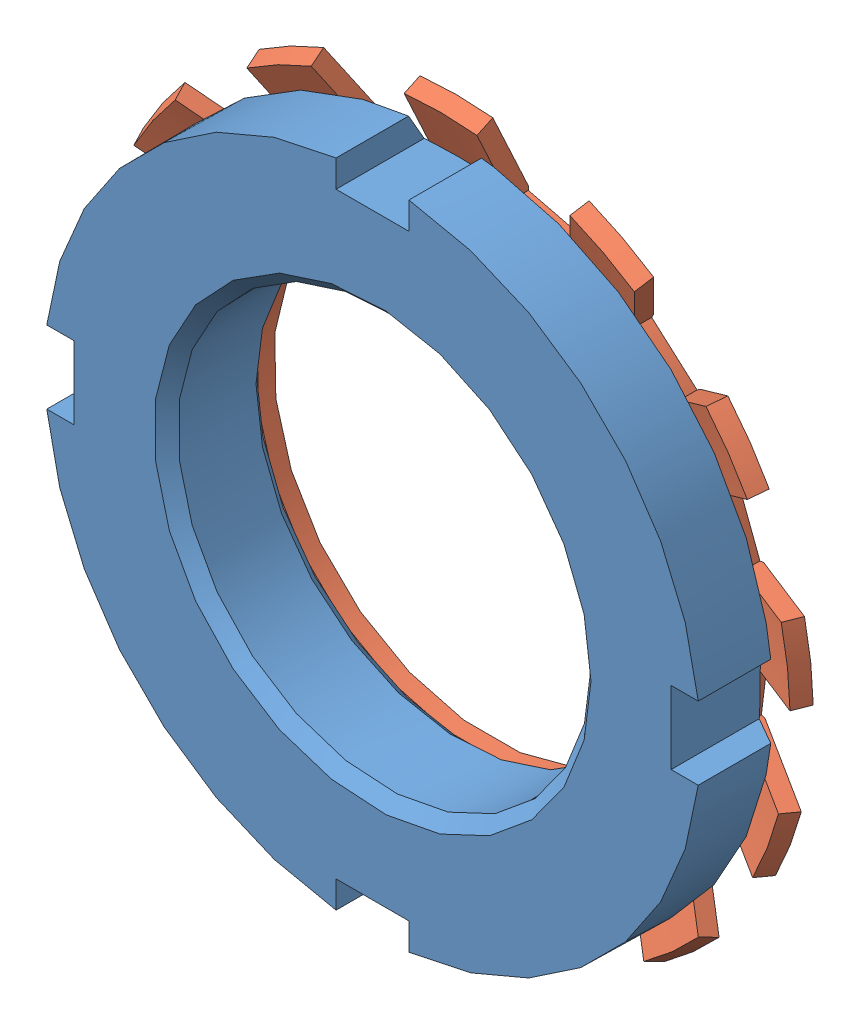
SolidWorks assembly JLNSK30.sldasm, configuration Default (file format 5000). Lengths in mm.
Overall size (48.99 48.76 9.5).
2 component instances, 2 part files, 0 mates.
Components (placement in the parent):
- JLNSK30nut-1: JLNSK30nut.sldprt [Default] at origin size (44.72 44.72 7)
- Washer30w-1: Washer30w.sldprt [Default] at (0 0 -8.2) size (48.99 48.76 4.83)
